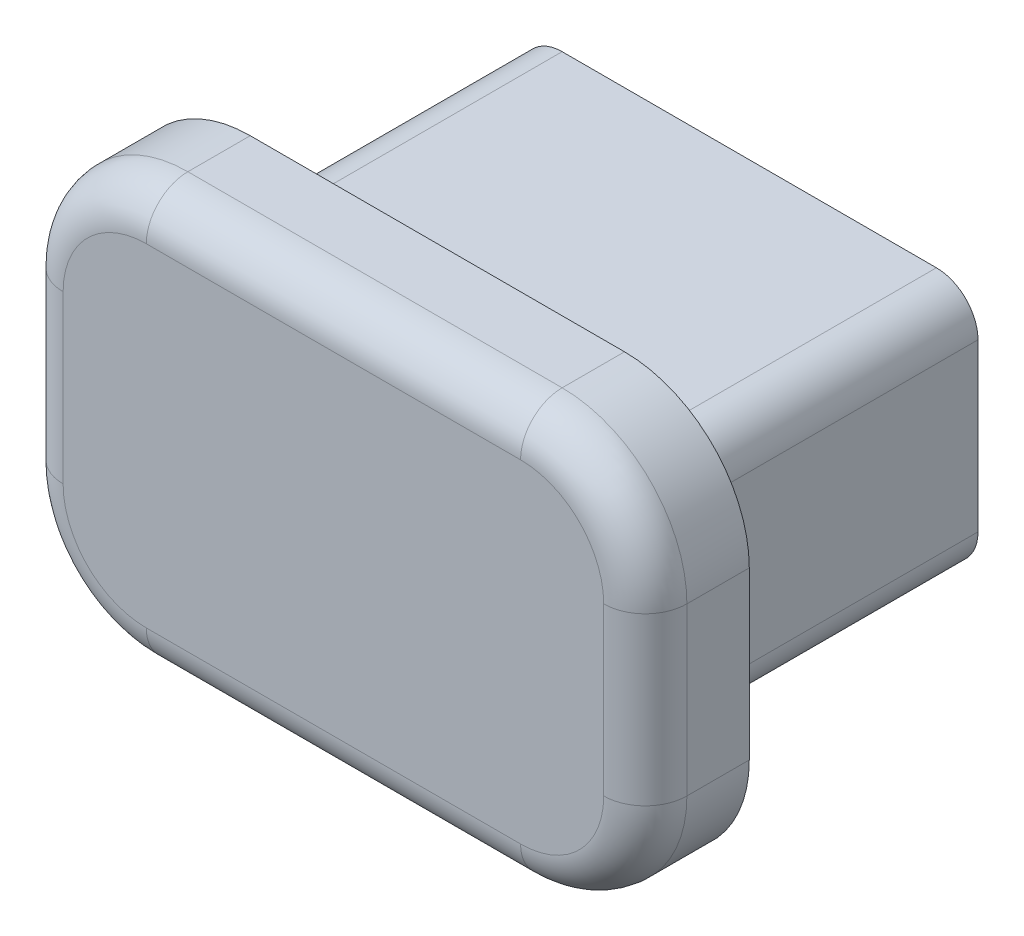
ISO-10303-21;
HEADER;
FILE_DESCRIPTION(('STEP AP214'),'2;1');
FILE_NAME('part.step','',(''),(''),'','','');
FILE_SCHEMA(('AUTOMOTIVE_DESIGN { 1 0 10303 214 1 1 1 1 }'));
ENDSEC;
DATA;
#1=APPLICATION_CONTEXT('core data for automotive mechanical design processes');
#2=APPLICATION_PROTOCOL_DEFINITION('international standard','automotive_design',2000,#1);
#3=PRODUCT_CONTEXT('',#1,'mechanical');
#4=PRODUCT('Part','Part','',(#3));
#5=PRODUCT_RELATED_PRODUCT_CATEGORY('part','',(#4));
#6=PRODUCT_DEFINITION_FORMATION('','',#4);
#7=PRODUCT_DEFINITION_CONTEXT('part definition',#1,'design');
#8=PRODUCT_DEFINITION('design','',#6,#7);
#9=PRODUCT_DEFINITION_SHAPE('','',#8);
#10=(LENGTH_UNIT() NAMED_UNIT(*) SI_UNIT(.MILLI.,.METRE.));
#11=(NAMED_UNIT(*) PLANE_ANGLE_UNIT() SI_UNIT($,.RADIAN.));
#12=(NAMED_UNIT(*) SI_UNIT($,.STERADIAN.) SOLID_ANGLE_UNIT());
#13=UNCERTAINTY_MEASURE_WITH_UNIT(LENGTH_MEASURE(1.E-05),#10,'distance_accuracy_value','');
#14=(GEOMETRIC_REPRESENTATION_CONTEXT(3) GLOBAL_UNCERTAINTY_ASSIGNED_CONTEXT((#13)) GLOBAL_UNIT_ASSIGNED_CONTEXT((#10,
#11,#12)) REPRESENTATION_CONTEXT('',''));
#15=CARTESIAN_POINT('',(0.,0.,0.));
#16=DIRECTION('',(0.,0.,1.));
#17=DIRECTION('',(1.,0.,0.));
#18=AXIS2_PLACEMENT_3D('',#15,#16,#17);
#19=CARTESIAN_POINT('',(-7.5,5.,10.));
#20=DIRECTION('',(1.,0.,0.));
#21=DIRECTION('',(0.,0.,-1.));
#22=AXIS2_PLACEMENT_3D('',#19,#20,#21);
#23=PLANE('',#22);
#24=DIRECTION('',(0.,0.,-1.));
#25=VECTOR('',#24,1.);
#26=CARTESIAN_POINT('',(-7.5,-2.,10.));
#27=LINE('',#26,#25);
#28=CARTESIAN_POINT('',(-7.5,-2.,7.5));
#29=VERTEX_POINT('',#28);
#30=CARTESIAN_POINT('',(-7.5,-2.,9.));
#31=VERTEX_POINT('',#30);
#32=EDGE_CURVE('E199',#29,#31,#27,.F.);
#33=ORIENTED_EDGE('',*,*,#32,.T.);
#34=DIRECTION('',(0.,-1.,0.));
#35=VECTOR('',#34,1.);
#36=CARTESIAN_POINT('',(-7.5,2.,9.));
#37=LINE('',#36,#35);
#38=CARTESIAN_POINT('',(-7.5,2.,9.));
#39=VERTEX_POINT('',#38);
#40=EDGE_CURVE('E237',#31,#39,#37,.F.);
#41=ORIENTED_EDGE('',*,*,#40,.T.);
#42=DIRECTION('',(0.,0.,-1.));
#43=VECTOR('',#42,1.);
#44=CARTESIAN_POINT('',(-7.5,2.,10.));
#45=LINE('',#44,#43);
#46=CARTESIAN_POINT('',(-7.5,2.,7.5));
#47=VERTEX_POINT('',#46);
#48=EDGE_CURVE('E192',#39,#47,#45,.T.);
#49=ORIENTED_EDGE('',*,*,#48,.T.);
#50=DIRECTION('',(0.,-1.,0.));
#51=VECTOR('',#50,1.);
#52=CARTESIAN_POINT('',(-7.5,5.,7.5));
#53=LINE('',#52,#51);
#54=EDGE_CURVE('E194',#47,#29,#53,.T.);
#55=ORIENTED_EDGE('',*,*,#54,.T.);
#56=EDGE_LOOP('',(#33,#41,#49,#55));
#57=FACE_BOUND('',#56,.T.);
#58=ADVANCED_FACE('F28',(#57),#23,.F.);
#59=CARTESIAN_POINT('',(-7.5,-5.,10.));
#60=DIRECTION('',(0.,1.,0.));
#61=DIRECTION('',(0.,0.,1.));
#62=AXIS2_PLACEMENT_3D('',#59,#60,#61);
#63=PLANE('',#62);
#64=DIRECTION('',(0.,0.,-1.));
#65=VECTOR('',#64,1.);
#66=CARTESIAN_POINT('',(4.5,-5.,10.));
#67=LINE('',#66,#65);
#68=CARTESIAN_POINT('',(4.5,-5.,7.5));
#69=VERTEX_POINT('',#68);
#70=CARTESIAN_POINT('',(4.5,-5.,9.));
#71=VERTEX_POINT('',#70);
#72=EDGE_CURVE('E181',#69,#71,#67,.F.);
#73=ORIENTED_EDGE('',*,*,#72,.T.);
#74=DIRECTION('',(1.,0.,0.));
#75=VECTOR('',#74,1.);
#76=CARTESIAN_POINT('',(-4.5,-5.,9.));
#77=LINE('',#76,#75);
#78=CARTESIAN_POINT('',(-4.5,-5.,9.));
#79=VERTEX_POINT('',#78);
#80=EDGE_CURVE('E233',#71,#79,#77,.F.);
#81=ORIENTED_EDGE('',*,*,#80,.T.);
#82=DIRECTION('',(0.,0.,-1.));
#83=VECTOR('',#82,1.);
#84=CARTESIAN_POINT('',(-4.5,-5.,10.));
#85=LINE('',#84,#83);
#86=CARTESIAN_POINT('',(-4.5,-5.,7.5));
#87=VERTEX_POINT('',#86);
#88=EDGE_CURVE('E184',#79,#87,#85,.T.);
#89=ORIENTED_EDGE('',*,*,#88,.T.);
#90=DIRECTION('',(1.,0.,0.));
#91=VECTOR('',#90,1.);
#92=CARTESIAN_POINT('',(-7.5,-5.,7.5));
#93=LINE('',#92,#91);
#94=EDGE_CURVE('E168',#87,#69,#93,.T.);
#95=ORIENTED_EDGE('',*,*,#94,.T.);
#96=EDGE_LOOP('',(#73,#81,#89,#95));
#97=FACE_BOUND('',#96,.T.);
#98=ADVANCED_FACE('F180',(#97),#63,.F.);
#99=CARTESIAN_POINT('',(7.5,5.,10.));
#100=DIRECTION('',(-1.,0.,0.));
#101=DIRECTION('',(0.,0.,1.));
#102=AXIS2_PLACEMENT_3D('',#99,#100,#101);
#103=PLANE('',#102);
#104=DIRECTION('',(0.,0.,-1.));
#105=VECTOR('',#104,1.);
#106=CARTESIAN_POINT('',(7.5,2.,10.));
#107=LINE('',#106,#105);
#108=CARTESIAN_POINT('',(7.5,2.,7.5));
#109=VERTEX_POINT('',#108);
#110=CARTESIAN_POINT('',(7.5,2.,9.));
#111=VERTEX_POINT('',#110);
#112=EDGE_CURVE('E176',#109,#111,#107,.F.);
#113=ORIENTED_EDGE('',*,*,#112,.T.);
#114=DIRECTION('',(0.,1.,0.));
#115=VECTOR('',#114,1.);
#116=CARTESIAN_POINT('',(7.5,-2.,9.));
#117=LINE('',#116,#115);
#118=CARTESIAN_POINT('',(7.5,-2.,9.));
#119=VERTEX_POINT('',#118);
#120=EDGE_CURVE('E230',#111,#119,#117,.F.);
#121=ORIENTED_EDGE('',*,*,#120,.T.);
#122=DIRECTION('',(0.,0.,-1.));
#123=VECTOR('',#122,1.);
#124=CARTESIAN_POINT('',(7.5,-2.,10.));
#125=LINE('',#124,#123);
#126=CARTESIAN_POINT('',(7.5,-2.,7.5));
#127=VERTEX_POINT('',#126);
#128=EDGE_CURVE('E207',#119,#127,#125,.T.);
#129=ORIENTED_EDGE('',*,*,#128,.T.);
#130=DIRECTION('',(0.,1.,0.));
#131=VECTOR('',#130,1.);
#132=CARTESIAN_POINT('',(7.5,5.,7.5));
#133=LINE('',#132,#131);
#134=EDGE_CURVE('E171',#127,#109,#133,.T.);
#135=ORIENTED_EDGE('',*,*,#134,.T.);
#136=EDGE_LOOP('',(#113,#121,#129,#135));
#137=FACE_BOUND('',#136,.T.);
#138=ADVANCED_FACE('F386',(#137),#103,.F.);
#139=CARTESIAN_POINT('',(-7.5,5.,10.));
#140=DIRECTION('',(0.,-1.,0.));
#141=DIRECTION('',(0.,0.,-1.));
#142=AXIS2_PLACEMENT_3D('',#139,#140,#141);
#143=PLANE('',#142);
#144=DIRECTION('',(0.,0.,-1.));
#145=VECTOR('',#144,1.);
#146=CARTESIAN_POINT('',(-4.5,5.,10.));
#147=LINE('',#146,#145);
#148=CARTESIAN_POINT('',(-4.5,5.,7.5));
#149=VERTEX_POINT('',#148);
#150=CARTESIAN_POINT('',(-4.5,5.,9.));
#151=VERTEX_POINT('',#150);
#152=EDGE_CURVE('E204',#149,#151,#147,.F.);
#153=ORIENTED_EDGE('',*,*,#152,.T.);
#154=DIRECTION('',(-1.,0.,0.));
#155=VECTOR('',#154,1.);
#156=CARTESIAN_POINT('',(4.5,5.,9.));
#157=LINE('',#156,#155);
#158=CARTESIAN_POINT('',(4.5,5.,9.));
#159=VERTEX_POINT('',#158);
#160=EDGE_CURVE('E241',#151,#159,#157,.F.);
#161=ORIENTED_EDGE('',*,*,#160,.T.);
#162=DIRECTION('',(0.,0.,-1.));
#163=VECTOR('',#162,1.);
#164=CARTESIAN_POINT('',(4.5,5.,10.));
#165=LINE('',#164,#163);
#166=CARTESIAN_POINT('',(4.5,5.,7.5));
#167=VERTEX_POINT('',#166);
#168=EDGE_CURVE('E202',#159,#167,#165,.T.);
#169=ORIENTED_EDGE('',*,*,#168,.T.);
#170=DIRECTION('',(-1.,0.,0.));
#171=VECTOR('',#170,1.);
#172=CARTESIAN_POINT('',(-7.5,5.,7.5));
#173=LINE('',#172,#171);
#174=EDGE_CURVE('E318',#167,#149,#173,.T.);
#175=ORIENTED_EDGE('',*,*,#174,.T.);
#176=EDGE_LOOP('',(#153,#161,#169,#175));
#177=FACE_BOUND('',#176,.T.);
#178=ADVANCED_FACE('F407',(#177),#143,.F.);
#179=CARTESIAN_POINT('',(-7.5,-5.,10.));
#180=DIRECTION('',(0.,0.,1.));
#181=DIRECTION('',(1.,0.,0.));
#182=AXIS2_PLACEMENT_3D('',#179,#180,#181);
#183=PLANE('',#182);
#184=DIRECTION('',(0.,1.,0.));
#185=VECTOR('',#184,1.);
#186=CARTESIAN_POINT('',(6.5,2.,10.));
#187=LINE('',#186,#185);
#188=CARTESIAN_POINT('',(6.5,-2.,10.));
#189=VERTEX_POINT('',#188);
#190=CARTESIAN_POINT('',(6.5,2.,10.));
#191=VERTEX_POINT('',#190);
#192=EDGE_CURVE('E222',#189,#191,#187,.T.);
#193=ORIENTED_EDGE('',*,*,#192,.T.);
#194=CARTESIAN_POINT('',(4.5,2.,10.));
#195=DIRECTION('',(0.,0.,1.));
#196=DIRECTION('',(1.,0.,0.));
#197=AXIS2_PLACEMENT_3D('',#194,#195,#196);
#198=CIRCLE('',#197,2.);
#199=CARTESIAN_POINT('',(4.5,4.,10.));
#200=VERTEX_POINT('',#199);
#201=EDGE_CURVE('E224',#191,#200,#198,.T.);
#202=ORIENTED_EDGE('',*,*,#201,.T.);
#203=DIRECTION('',(-1.,0.,0.));
#204=VECTOR('',#203,1.);
#205=CARTESIAN_POINT('',(-4.5,4.,10.));
#206=LINE('',#205,#204);
#207=CARTESIAN_POINT('',(-4.5,4.,10.));
#208=VERTEX_POINT('',#207);
#209=EDGE_CURVE('E175',#200,#208,#206,.T.);
#210=ORIENTED_EDGE('',*,*,#209,.T.);
#211=CARTESIAN_POINT('',(-4.5,2.,10.));
#212=DIRECTION('',(0.,0.,1.));
#213=DIRECTION('',(1.,0.,0.));
#214=AXIS2_PLACEMENT_3D('',#211,#212,#213);
#215=CIRCLE('',#214,2.);
#216=CARTESIAN_POINT('',(-6.5,2.,10.));
#217=VERTEX_POINT('',#216);
#218=EDGE_CURVE('E212',#208,#217,#215,.T.);
#219=ORIENTED_EDGE('',*,*,#218,.T.);
#220=DIRECTION('',(0.,-1.,0.));
#221=VECTOR('',#220,1.);
#222=CARTESIAN_POINT('',(-6.5,-2.,10.));
#223=LINE('',#222,#221);
#224=CARTESIAN_POINT('',(-6.5,-2.,10.));
#225=VERTEX_POINT('',#224);
#226=EDGE_CURVE('E214',#217,#225,#223,.T.);
#227=ORIENTED_EDGE('',*,*,#226,.T.);
#228=CARTESIAN_POINT('',(-4.5,-2.,10.));
#229=DIRECTION('',(0.,0.,1.));
#230=DIRECTION('',(1.,0.,0.));
#231=AXIS2_PLACEMENT_3D('',#228,#229,#230);
#232=CIRCLE('',#231,2.);
#233=CARTESIAN_POINT('',(-4.5,-4.,10.));
#234=VERTEX_POINT('',#233);
#235=EDGE_CURVE('E216',#225,#234,#232,.T.);
#236=ORIENTED_EDGE('',*,*,#235,.T.);
#237=DIRECTION('',(1.,0.,0.));
#238=VECTOR('',#237,1.);
#239=CARTESIAN_POINT('',(4.5,-4.,10.));
#240=LINE('',#239,#238);
#241=CARTESIAN_POINT('',(4.5,-4.,10.));
#242=VERTEX_POINT('',#241);
#243=EDGE_CURVE('E218',#234,#242,#240,.T.);
#244=ORIENTED_EDGE('',*,*,#243,.T.);
#245=CARTESIAN_POINT('',(4.5,-2.,10.));
#246=DIRECTION('',(0.,0.,1.));
#247=DIRECTION('',(1.,0.,0.));
#248=AXIS2_PLACEMENT_3D('',#245,#246,#247);
#249=CIRCLE('',#248,2.);
#250=EDGE_CURVE('E220',#242,#189,#249,.T.);
#251=ORIENTED_EDGE('',*,*,#250,.T.);
#252=EDGE_LOOP('',(#193,#202,#210,#219,#227,#236,#244,#251));
#253=FACE_BOUND('',#252,.T.);
#254=ADVANCED_FACE('F372',(#253),#183,.T.);
#255=CARTESIAN_POINT('',(-4.5,-2.,10.));
#256=DIRECTION('',(0.,0.,-1.));
#257=DIRECTION('',(-1.,0.,0.));
#258=AXIS2_PLACEMENT_3D('',#255,#256,#257);
#259=CYLINDRICAL_SURFACE('',#258,3.);
#260=ORIENTED_EDGE('',*,*,#88,.F.);
#261=CARTESIAN_POINT('',(-4.5,-2.,9.));
#262=DIRECTION('',(0.,0.,1.));
#263=DIRECTION('',(1.,0.,0.));
#264=AXIS2_PLACEMENT_3D('',#261,#262,#263);
#265=CIRCLE('',#264,3.);
#266=EDGE_CURVE('E235',#79,#31,#265,.F.);
#267=ORIENTED_EDGE('',*,*,#266,.T.);
#268=ORIENTED_EDGE('',*,*,#32,.F.);
#269=CARTESIAN_POINT('',(-4.5,-2.,7.5));
#270=DIRECTION('',(0.,0.,1.));
#271=DIRECTION('',(1.,0.,0.));
#272=AXIS2_PLACEMENT_3D('',#269,#270,#271);
#273=CIRCLE('',#272,3.);
#274=EDGE_CURVE('E316',#87,#29,#273,.F.);
#275=ORIENTED_EDGE('',*,*,#274,.F.);
#276=EDGE_LOOP('',(#260,#267,#268,#275));
#277=FACE_BOUND('',#276,.T.);
#278=ADVANCED_FACE('F328',(#277),#259,.T.);
#279=CARTESIAN_POINT('',(-4.5,2.,10.));
#280=DIRECTION('',(0.,0.,-1.));
#281=DIRECTION('',(-1.,0.,0.));
#282=AXIS2_PLACEMENT_3D('',#279,#280,#281);
#283=CYLINDRICAL_SURFACE('',#282,3.);
#284=ORIENTED_EDGE('',*,*,#48,.F.);
#285=CARTESIAN_POINT('',(-4.5,2.,9.));
#286=DIRECTION('',(0.,0.,1.));
#287=DIRECTION('',(1.,0.,0.));
#288=AXIS2_PLACEMENT_3D('',#285,#286,#287);
#289=CIRCLE('',#288,3.);
#290=EDGE_CURVE('E239',#39,#151,#289,.F.);
#291=ORIENTED_EDGE('',*,*,#290,.T.);
#292=ORIENTED_EDGE('',*,*,#152,.F.);
#293=CARTESIAN_POINT('',(-4.5,2.,7.5));
#294=DIRECTION('',(0.,0.,1.));
#295=DIRECTION('',(1.,0.,0.));
#296=AXIS2_PLACEMENT_3D('',#293,#294,#295);
#297=CIRCLE('',#296,3.);
#298=EDGE_CURVE('E190',#47,#149,#297,.F.);
#299=ORIENTED_EDGE('',*,*,#298,.F.);
#300=EDGE_LOOP('',(#284,#291,#292,#299));
#301=FACE_BOUND('',#300,.T.);
#302=ADVANCED_FACE('F419',(#301),#283,.T.);
#303=CARTESIAN_POINT('',(4.5,2.,10.));
#304=DIRECTION('',(0.,0.,-1.));
#305=DIRECTION('',(-1.,0.,0.));
#306=AXIS2_PLACEMENT_3D('',#303,#304,#305);
#307=CYLINDRICAL_SURFACE('',#306,3.);
#308=ORIENTED_EDGE('',*,*,#168,.F.);
#309=CARTESIAN_POINT('',(4.5,2.,9.));
#310=DIRECTION('',(0.,0.,1.));
#311=DIRECTION('',(1.,0.,0.));
#312=AXIS2_PLACEMENT_3D('',#309,#310,#311);
#313=CIRCLE('',#312,3.);
#314=EDGE_CURVE('E227',#159,#111,#313,.F.);
#315=ORIENTED_EDGE('',*,*,#314,.T.);
#316=ORIENTED_EDGE('',*,*,#112,.F.);
#317=CARTESIAN_POINT('',(4.5,2.,7.5));
#318=DIRECTION('',(0.,0.,1.));
#319=DIRECTION('',(1.,0.,0.));
#320=AXIS2_PLACEMENT_3D('',#317,#318,#319);
#321=CIRCLE('',#320,3.);
#322=EDGE_CURVE('E185',#167,#109,#321,.F.);
#323=ORIENTED_EDGE('',*,*,#322,.F.);
#324=EDGE_LOOP('',(#308,#315,#316,#323));
#325=FACE_BOUND('',#324,.T.);
#326=ADVANCED_FACE('F384',(#325),#307,.T.);
#327=CARTESIAN_POINT('',(4.5,-2.,10.));
#328=DIRECTION('',(0.,0.,-1.));
#329=DIRECTION('',(-1.,0.,0.));
#330=AXIS2_PLACEMENT_3D('',#327,#328,#329);
#331=CYLINDRICAL_SURFACE('',#330,3.);
#332=ORIENTED_EDGE('',*,*,#128,.F.);
#333=CARTESIAN_POINT('',(4.5,-2.,9.));
#334=DIRECTION('',(0.,0.,1.));
#335=DIRECTION('',(1.,0.,0.));
#336=AXIS2_PLACEMENT_3D('',#333,#334,#335);
#337=CIRCLE('',#336,3.);
#338=EDGE_CURVE('E189',#119,#71,#337,.F.);
#339=ORIENTED_EDGE('',*,*,#338,.T.);
#340=ORIENTED_EDGE('',*,*,#72,.F.);
#341=CARTESIAN_POINT('',(4.5,-2.,7.5));
#342=DIRECTION('',(0.,0.,1.));
#343=DIRECTION('',(1.,0.,0.));
#344=AXIS2_PLACEMENT_3D('',#341,#342,#343);
#345=CIRCLE('',#344,3.);
#346=EDGE_CURVE('E165',#127,#69,#345,.F.);
#347=ORIENTED_EDGE('',*,*,#346,.F.);
#348=EDGE_LOOP('',(#332,#339,#340,#347));
#349=FACE_BOUND('',#348,.T.);
#350=ADVANCED_FACE('F187',(#349),#331,.T.);
#351=CARTESIAN_POINT('',(5.5,3.,28.8667837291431));
#352=DIRECTION('',(1.,0.,0.));
#353=DIRECTION('',(0.,1.,0.));
#354=AXIS2_PLACEMENT_3D('',#351,#352,#353);
#355=PLANE('',#354);
#356=DIRECTION('',(0.,-1.,0.));
#357=VECTOR('',#356,1.);
#358=CARTESIAN_POINT('',(5.5,3.,7.5));
#359=LINE('',#358,#357);
#360=CARTESIAN_POINT('',(5.5,2.,7.5));
#361=VERTEX_POINT('',#360);
#362=CARTESIAN_POINT('',(5.5,-2.,7.5));
#363=VERTEX_POINT('',#362);
#364=EDGE_CURVE('E308',#361,#363,#359,.T.);
#365=ORIENTED_EDGE('',*,*,#364,.T.);
#366=DIRECTION('',(0.,0.,-1.));
#367=VECTOR('',#366,1.);
#368=CARTESIAN_POINT('',(5.5,-2.,28.8667837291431));
#369=LINE('',#368,#367);
#370=CARTESIAN_POINT('',(5.5,-2.,0.));
#371=VERTEX_POINT('',#370);
#372=EDGE_CURVE('E245',#363,#371,#369,.T.);
#373=ORIENTED_EDGE('',*,*,#372,.T.);
#374=DIRECTION('',(0.,-1.,0.));
#375=VECTOR('',#374,1.);
#376=CARTESIAN_POINT('',(5.5,3.,0.));
#377=LINE('',#376,#375);
#378=CARTESIAN_POINT('',(5.5,2.,0.));
#379=VERTEX_POINT('',#378);
#380=EDGE_CURVE('E297',#379,#371,#377,.T.);
#381=ORIENTED_EDGE('',*,*,#380,.F.);
#382=DIRECTION('',(0.,0.,-1.));
#383=VECTOR('',#382,1.);
#384=CARTESIAN_POINT('',(5.5,2.,28.8667837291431));
#385=LINE('',#384,#383);
#386=EDGE_CURVE('E243',#379,#361,#385,.F.);
#387=ORIENTED_EDGE('',*,*,#386,.T.);
#388=EDGE_LOOP('',(#365,#373,#381,#387));
#389=FACE_BOUND('',#388,.T.);
#390=ADVANCED_FACE('F427',(#389),#355,.T.);
#391=CARTESIAN_POINT('',(5.5,3.,28.8667837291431));
#392=DIRECTION('',(0.,1.,0.));
#393=DIRECTION('',(0.,0.,1.));
#394=AXIS2_PLACEMENT_3D('',#391,#392,#393);
#395=PLANE('',#394);
#396=DIRECTION('',(1.,0.,0.));
#397=VECTOR('',#396,1.);
#398=CARTESIAN_POINT('',(5.5,3.,0.));
#399=LINE('',#398,#397);
#400=CARTESIAN_POINT('',(-4.5,3.,0.));
#401=VERTEX_POINT('',#400);
#402=CARTESIAN_POINT('',(4.5,3.,0.));
#403=VERTEX_POINT('',#402);
#404=EDGE_CURVE('E293',#401,#403,#399,.T.);
#405=ORIENTED_EDGE('',*,*,#404,.F.);
#406=DIRECTION('',(0.,0.,-1.));
#407=VECTOR('',#406,1.);
#408=CARTESIAN_POINT('',(-4.5,3.,28.8667837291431));
#409=LINE('',#408,#407);
#410=CARTESIAN_POINT('',(-4.5,3.,7.5));
#411=VERTEX_POINT('',#410);
#412=EDGE_CURVE('E47',#401,#411,#409,.F.);
#413=ORIENTED_EDGE('',*,*,#412,.T.);
#414=DIRECTION('',(1.,0.,0.));
#415=VECTOR('',#414,1.);
#416=CARTESIAN_POINT('',(5.5,3.,7.5));
#417=LINE('',#416,#415);
#418=CARTESIAN_POINT('',(4.5,3.,7.5));
#419=VERTEX_POINT('',#418);
#420=EDGE_CURVE('E278',#411,#419,#417,.T.);
#421=ORIENTED_EDGE('',*,*,#420,.T.);
#422=DIRECTION('',(0.,0.,-1.));
#423=VECTOR('',#422,1.);
#424=CARTESIAN_POINT('',(4.5,3.,28.8667837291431));
#425=LINE('',#424,#423);
#426=EDGE_CURVE('E266',#419,#403,#425,.T.);
#427=ORIENTED_EDGE('',*,*,#426,.T.);
#428=EDGE_LOOP('',(#405,#413,#421,#427));
#429=FACE_BOUND('',#428,.T.);
#430=ADVANCED_FACE('F295',(#429),#395,.T.);
#431=CARTESIAN_POINT('',(-5.5,3.,28.8667837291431));
#432=DIRECTION('',(-1.,0.,0.));
#433=DIRECTION('',(0.,-1.,0.));
#434=AXIS2_PLACEMENT_3D('',#431,#432,#433);
#435=PLANE('',#434);
#436=DIRECTION('',(0.,1.,0.));
#437=VECTOR('',#436,1.);
#438=CARTESIAN_POINT('',(-5.5,3.,0.));
#439=LINE('',#438,#437);
#440=CARTESIAN_POINT('',(-5.5,-2.,0.));
#441=VERTEX_POINT('',#440);
#442=CARTESIAN_POINT('',(-5.5,2.,0.));
#443=VERTEX_POINT('',#442);
#444=EDGE_CURVE('E294',#441,#443,#439,.T.);
#445=ORIENTED_EDGE('',*,*,#444,.F.);
#446=DIRECTION('',(0.,0.,-1.));
#447=VECTOR('',#446,1.);
#448=CARTESIAN_POINT('',(-5.5,-2.,28.8667837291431));
#449=LINE('',#448,#447);
#450=CARTESIAN_POINT('',(-5.5,-2.,7.5));
#451=VERTEX_POINT('',#450);
#452=EDGE_CURVE('E264',#441,#451,#449,.F.);
#453=ORIENTED_EDGE('',*,*,#452,.T.);
#454=DIRECTION('',(0.,1.,0.));
#455=VECTOR('',#454,1.);
#456=CARTESIAN_POINT('',(-5.5,3.,7.5));
#457=LINE('',#456,#455);
#458=CARTESIAN_POINT('',(-5.5,2.,7.5));
#459=VERTEX_POINT('',#458);
#460=EDGE_CURVE('E276',#451,#459,#457,.T.);
#461=ORIENTED_EDGE('',*,*,#460,.T.);
#462=DIRECTION('',(0.,0.,-1.));
#463=VECTOR('',#462,1.);
#464=CARTESIAN_POINT('',(-5.5,2.,28.8667837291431));
#465=LINE('',#464,#463);
#466=EDGE_CURVE('E261',#459,#443,#465,.T.);
#467=ORIENTED_EDGE('',*,*,#466,.T.);
#468=EDGE_LOOP('',(#445,#453,#461,#467));
#469=FACE_BOUND('',#468,.T.);
#470=ADVANCED_FACE('F283',(#469),#435,.T.);
#471=CARTESIAN_POINT('',(5.5,-3.,28.8667837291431));
#472=DIRECTION('',(0.,-1.,0.));
#473=DIRECTION('',(0.,0.,-1.));
#474=AXIS2_PLACEMENT_3D('',#471,#472,#473);
#475=PLANE('',#474);
#476=DIRECTION('',(-1.,0.,0.));
#477=VECTOR('',#476,1.);
#478=CARTESIAN_POINT('',(5.5,-3.,0.));
#479=LINE('',#478,#477);
#480=CARTESIAN_POINT('',(4.5,-3.,0.));
#481=VERTEX_POINT('',#480);
#482=CARTESIAN_POINT('',(-4.5,-3.,0.));
#483=VERTEX_POINT('',#482);
#484=EDGE_CURVE('E299',#481,#483,#479,.T.);
#485=ORIENTED_EDGE('',*,*,#484,.F.);
#486=DIRECTION('',(0.,0.,-1.));
#487=VECTOR('',#486,1.);
#488=CARTESIAN_POINT('',(4.5,-3.,28.8667837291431));
#489=LINE('',#488,#487);
#490=CARTESIAN_POINT('',(4.5,-3.,7.5));
#491=VERTEX_POINT('',#490);
#492=EDGE_CURVE('E259',#481,#491,#489,.F.);
#493=ORIENTED_EDGE('',*,*,#492,.T.);
#494=DIRECTION('',(-1.,0.,0.));
#495=VECTOR('',#494,1.);
#496=CARTESIAN_POINT('',(5.5,-3.,7.5));
#497=LINE('',#496,#495);
#498=CARTESIAN_POINT('',(-4.5,-3.,7.5));
#499=VERTEX_POINT('',#498);
#500=EDGE_CURVE('E286',#491,#499,#497,.T.);
#501=ORIENTED_EDGE('',*,*,#500,.T.);
#502=DIRECTION('',(0.,0.,-1.));
#503=VECTOR('',#502,1.);
#504=CARTESIAN_POINT('',(-4.5,-3.,28.8667837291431));
#505=LINE('',#504,#503);
#506=EDGE_CURVE('E256',#499,#483,#505,.T.);
#507=ORIENTED_EDGE('',*,*,#506,.T.);
#508=EDGE_LOOP('',(#485,#493,#501,#507));
#509=FACE_BOUND('',#508,.T.);
#510=ADVANCED_FACE('F430',(#509),#475,.T.);
#511=CARTESIAN_POINT('',(-7.5,-5.,7.5));
#512=DIRECTION('',(0.,0.,1.));
#513=DIRECTION('',(1.,0.,0.));
#514=AXIS2_PLACEMENT_3D('',#511,#512,#513);
#515=PLANE('',#514);
#516=ORIENTED_EDGE('',*,*,#298,.T.);
#517=ORIENTED_EDGE('',*,*,#174,.F.);
#518=ORIENTED_EDGE('',*,*,#322,.T.);
#519=ORIENTED_EDGE('',*,*,#134,.F.);
#520=ORIENTED_EDGE('',*,*,#346,.T.);
#521=ORIENTED_EDGE('',*,*,#94,.F.);
#522=ORIENTED_EDGE('',*,*,#274,.T.);
#523=ORIENTED_EDGE('',*,*,#54,.F.);
#524=EDGE_LOOP('',(#516,#517,#518,#519,#520,#521,#522,#523));
#525=FACE_BOUND('',#524,.T.);
#526=ORIENTED_EDGE('',*,*,#420,.F.);
#527=CARTESIAN_POINT('',(-4.5,2.,7.5));
#528=DIRECTION('',(0.,0.,1.));
#529=DIRECTION('',(1.,0.,0.));
#530=AXIS2_PLACEMENT_3D('',#527,#528,#529);
#531=CIRCLE('',#530,1.);
#532=EDGE_CURVE('E35',#411,#459,#531,.T.);
#533=ORIENTED_EDGE('',*,*,#532,.T.);
#534=ORIENTED_EDGE('',*,*,#460,.F.);
#535=CARTESIAN_POINT('',(-4.5,-2.,7.5));
#536=DIRECTION('',(0.,0.,1.));
#537=DIRECTION('',(1.,0.,0.));
#538=AXIS2_PLACEMENT_3D('',#535,#536,#537);
#539=CIRCLE('',#538,1.);
#540=EDGE_CURVE('E272',#451,#499,#539,.T.);
#541=ORIENTED_EDGE('',*,*,#540,.T.);
#542=ORIENTED_EDGE('',*,*,#500,.F.);
#543=CARTESIAN_POINT('',(4.5,-2.,7.5));
#544=DIRECTION('',(0.,0.,1.));
#545=DIRECTION('',(1.,0.,0.));
#546=AXIS2_PLACEMENT_3D('',#543,#544,#545);
#547=CIRCLE('',#546,1.);
#548=EDGE_CURVE('E270',#491,#363,#547,.T.);
#549=ORIENTED_EDGE('',*,*,#548,.T.);
#550=ORIENTED_EDGE('',*,*,#364,.F.);
#551=CARTESIAN_POINT('',(4.5,2.,7.5));
#552=DIRECTION('',(0.,0.,1.));
#553=DIRECTION('',(1.,0.,0.));
#554=AXIS2_PLACEMENT_3D('',#551,#552,#553);
#555=CIRCLE('',#554,1.);
#556=EDGE_CURVE('E12',#361,#419,#555,.T.);
#557=ORIENTED_EDGE('',*,*,#556,.T.);
#558=EDGE_LOOP('',(#526,#533,#534,#541,#542,#549,#550,#557));
#559=FACE_BOUND('',#558,.T.);
#560=ADVANCED_FACE('F167',(#525,#559),#515,.F.);
#561=CARTESIAN_POINT('',(-7.5,-5.,0.));
#562=DIRECTION('',(0.,0.,1.));
#563=DIRECTION('',(1.,0.,0.));
#564=AXIS2_PLACEMENT_3D('',#561,#562,#563);
#565=PLANE('',#564);
#566=ORIENTED_EDGE('',*,*,#380,.T.);
#567=CARTESIAN_POINT('',(4.5,-2.,0.));
#568=DIRECTION('',(0.,0.,1.));
#569=DIRECTION('',(1.,0.,0.));
#570=AXIS2_PLACEMENT_3D('',#567,#568,#569);
#571=CIRCLE('',#570,1.);
#572=EDGE_CURVE('E254',#371,#481,#571,.F.);
#573=ORIENTED_EDGE('',*,*,#572,.T.);
#574=ORIENTED_EDGE('',*,*,#484,.T.);
#575=CARTESIAN_POINT('',(-4.5,-2.,0.));
#576=DIRECTION('',(0.,0.,1.));
#577=DIRECTION('',(1.,0.,0.));
#578=AXIS2_PLACEMENT_3D('',#575,#576,#577);
#579=CIRCLE('',#578,1.);
#580=EDGE_CURVE('E252',#483,#441,#579,.F.);
#581=ORIENTED_EDGE('',*,*,#580,.T.);
#582=ORIENTED_EDGE('',*,*,#444,.T.);
#583=CARTESIAN_POINT('',(-4.5,2.,0.));
#584=DIRECTION('',(0.,0.,1.));
#585=DIRECTION('',(1.,0.,0.));
#586=AXIS2_PLACEMENT_3D('',#583,#584,#585);
#587=CIRCLE('',#586,1.);
#588=EDGE_CURVE('E250',#443,#401,#587,.F.);
#589=ORIENTED_EDGE('',*,*,#588,.T.);
#590=ORIENTED_EDGE('',*,*,#404,.T.);
#591=CARTESIAN_POINT('',(4.5,2.,0.));
#592=DIRECTION('',(0.,0.,1.));
#593=DIRECTION('',(1.,0.,0.));
#594=AXIS2_PLACEMENT_3D('',#591,#592,#593);
#595=CIRCLE('',#594,1.);
#596=EDGE_CURVE('E248',#403,#379,#595,.F.);
#597=ORIENTED_EDGE('',*,*,#596,.T.);
#598=EDGE_LOOP('',(#566,#573,#574,#581,#582,#589,#590,#597));
#599=FACE_BOUND('',#598,.T.);
#600=ADVANCED_FACE('F292',(#599),#565,.F.);
#601=CARTESIAN_POINT('',(-4.5,-2.,9.));
#602=DIRECTION('',(0.,0.,1.));
#603=DIRECTION('',(1.,0.,0.));
#604=AXIS2_PLACEMENT_3D('',#601,#602,#603);
#605=TOROIDAL_SURFACE('',#604,2.,1.);
#606=CARTESIAN_POINT('',(-6.5,-2.,9.));
#607=DIRECTION('',(0.,1.,0.));
#608=DIRECTION('',(0.,0.,1.));
#609=AXIS2_PLACEMENT_3D('',#606,#607,#608);
#610=CIRCLE('',#609,1.);
#611=EDGE_CURVE('E337',#31,#225,#610,.T.);
#612=ORIENTED_EDGE('',*,*,#611,.F.);
#613=ORIENTED_EDGE('',*,*,#266,.F.);
#614=CARTESIAN_POINT('',(-4.5,-4.,9.));
#615=DIRECTION('',(1.,0.,0.));
#616=DIRECTION('',(0.,0.,-1.));
#617=AXIS2_PLACEMENT_3D('',#614,#615,#616);
#618=CIRCLE('',#617,1.);
#619=EDGE_CURVE('E301',#234,#79,#618,.T.);
#620=ORIENTED_EDGE('',*,*,#619,.F.);
#621=ORIENTED_EDGE('',*,*,#235,.F.);
#622=EDGE_LOOP('',(#612,#613,#620,#621));
#623=FACE_BOUND('',#622,.T.);
#624=ADVANCED_FACE('F333',(#623),#605,.T.);
#625=CARTESIAN_POINT('',(-7.5,-4.,9.));
#626=DIRECTION('',(-1.,0.,0.));
#627=DIRECTION('',(0.,0.,1.));
#628=AXIS2_PLACEMENT_3D('',#625,#626,#627);
#629=CYLINDRICAL_SURFACE('',#628,1.);
#630=ORIENTED_EDGE('',*,*,#619,.T.);
#631=ORIENTED_EDGE('',*,*,#80,.F.);
#632=CARTESIAN_POINT('',(4.5,-4.,9.));
#633=DIRECTION('',(1.,0.,0.));
#634=DIRECTION('',(0.,0.,-1.));
#635=AXIS2_PLACEMENT_3D('',#632,#633,#634);
#636=CIRCLE('',#635,1.);
#637=EDGE_CURVE('E343',#242,#71,#636,.T.);
#638=ORIENTED_EDGE('',*,*,#637,.F.);
#639=ORIENTED_EDGE('',*,*,#243,.F.);
#640=EDGE_LOOP('',(#630,#631,#638,#639));
#641=FACE_BOUND('',#640,.T.);
#642=ADVANCED_FACE('F340',(#641),#629,.T.);
#643=CARTESIAN_POINT('',(-6.5,-5.,9.));
#644=DIRECTION('',(0.,1.,0.));
#645=DIRECTION('',(0.,0.,1.));
#646=AXIS2_PLACEMENT_3D('',#643,#644,#645);
#647=CYLINDRICAL_SURFACE('',#646,1.);
#648=ORIENTED_EDGE('',*,*,#611,.T.);
#649=ORIENTED_EDGE('',*,*,#226,.F.);
#650=CARTESIAN_POINT('',(-6.5,2.,9.));
#651=DIRECTION('',(0.,1.,0.));
#652=DIRECTION('',(0.,0.,1.));
#653=AXIS2_PLACEMENT_3D('',#650,#651,#652);
#654=CIRCLE('',#653,1.);
#655=EDGE_CURVE('E346',#39,#217,#654,.T.);
#656=ORIENTED_EDGE('',*,*,#655,.F.);
#657=ORIENTED_EDGE('',*,*,#40,.F.);
#658=EDGE_LOOP('',(#648,#649,#656,#657));
#659=FACE_BOUND('',#658,.T.);
#660=ADVANCED_FACE('F391',(#659),#647,.T.);
#661=CARTESIAN_POINT('',(4.5,-2.,9.));
#662=DIRECTION('',(0.,0.,1.));
#663=DIRECTION('',(1.,0.,0.));
#664=AXIS2_PLACEMENT_3D('',#661,#662,#663);
#665=TOROIDAL_SURFACE('',#664,2.,1.);
#666=ORIENTED_EDGE('',*,*,#637,.T.);
#667=ORIENTED_EDGE('',*,*,#338,.F.);
#668=CARTESIAN_POINT('',(6.5,-2.,9.));
#669=DIRECTION('',(0.,1.,0.));
#670=DIRECTION('',(0.,0.,1.));
#671=AXIS2_PLACEMENT_3D('',#668,#669,#670);
#672=CIRCLE('',#671,1.);
#673=EDGE_CURVE('E351',#189,#119,#672,.T.);
#674=ORIENTED_EDGE('',*,*,#673,.F.);
#675=ORIENTED_EDGE('',*,*,#250,.F.);
#676=EDGE_LOOP('',(#666,#667,#674,#675));
#677=FACE_BOUND('',#676,.T.);
#678=ADVANCED_FACE('F388',(#677),#665,.T.);
#679=CARTESIAN_POINT('',(-4.5,2.,9.));
#680=DIRECTION('',(0.,0.,1.));
#681=DIRECTION('',(1.,0.,0.));
#682=AXIS2_PLACEMENT_3D('',#679,#680,#681);
#683=TOROIDAL_SURFACE('',#682,2.,1.);
#684=ORIENTED_EDGE('',*,*,#655,.T.);
#685=ORIENTED_EDGE('',*,*,#218,.F.);
#686=CARTESIAN_POINT('',(-4.5,4.,9.));
#687=DIRECTION('',(1.,0.,0.));
#688=DIRECTION('',(0.,0.,-1.));
#689=AXIS2_PLACEMENT_3D('',#686,#687,#688);
#690=CIRCLE('',#689,1.);
#691=EDGE_CURVE('E354',#151,#208,#690,.T.);
#692=ORIENTED_EDGE('',*,*,#691,.F.);
#693=ORIENTED_EDGE('',*,*,#290,.F.);
#694=EDGE_LOOP('',(#684,#685,#692,#693));
#695=FACE_BOUND('',#694,.T.);
#696=ADVANCED_FACE('F390',(#695),#683,.T.);
#697=CARTESIAN_POINT('',(6.5,-5.,9.));
#698=DIRECTION('',(0.,-1.,0.));
#699=DIRECTION('',(0.,0.,-1.));
#700=AXIS2_PLACEMENT_3D('',#697,#698,#699);
#701=CYLINDRICAL_SURFACE('',#700,1.);
#702=ORIENTED_EDGE('',*,*,#673,.T.);
#703=ORIENTED_EDGE('',*,*,#120,.F.);
#704=CARTESIAN_POINT('',(6.5,2.,9.));
#705=DIRECTION('',(0.,1.,0.));
#706=DIRECTION('',(0.,0.,1.));
#707=AXIS2_PLACEMENT_3D('',#704,#705,#706);
#708=CIRCLE('',#707,1.);
#709=EDGE_CURVE('E357',#191,#111,#708,.T.);
#710=ORIENTED_EDGE('',*,*,#709,.F.);
#711=ORIENTED_EDGE('',*,*,#192,.F.);
#712=EDGE_LOOP('',(#702,#703,#710,#711));
#713=FACE_BOUND('',#712,.T.);
#714=ADVANCED_FACE('F379',(#713),#701,.T.);
#715=CARTESIAN_POINT('',(-7.5,4.,9.));
#716=DIRECTION('',(1.,0.,0.));
#717=DIRECTION('',(0.,0.,-1.));
#718=AXIS2_PLACEMENT_3D('',#715,#716,#717);
#719=CYLINDRICAL_SURFACE('',#718,1.);
#720=ORIENTED_EDGE('',*,*,#691,.T.);
#721=ORIENTED_EDGE('',*,*,#209,.F.);
#722=CARTESIAN_POINT('',(4.5,4.,9.));
#723=DIRECTION('',(1.,0.,0.));
#724=DIRECTION('',(0.,0.,-1.));
#725=AXIS2_PLACEMENT_3D('',#722,#723,#724);
#726=CIRCLE('',#725,1.);
#727=EDGE_CURVE('E359',#159,#200,#726,.T.);
#728=ORIENTED_EDGE('',*,*,#727,.F.);
#729=ORIENTED_EDGE('',*,*,#160,.F.);
#730=EDGE_LOOP('',(#720,#721,#728,#729));
#731=FACE_BOUND('',#730,.T.);
#732=ADVANCED_FACE('F368',(#731),#719,.T.);
#733=CARTESIAN_POINT('',(4.5,2.,9.));
#734=DIRECTION('',(0.,0.,1.));
#735=DIRECTION('',(1.,0.,0.));
#736=AXIS2_PLACEMENT_3D('',#733,#734,#735);
#737=TOROIDAL_SURFACE('',#736,2.,1.);
#738=ORIENTED_EDGE('',*,*,#709,.T.);
#739=ORIENTED_EDGE('',*,*,#314,.F.);
#740=ORIENTED_EDGE('',*,*,#727,.T.);
#741=ORIENTED_EDGE('',*,*,#201,.F.);
#742=EDGE_LOOP('',(#738,#739,#740,#741));
#743=FACE_BOUND('',#742,.T.);
#744=ADVANCED_FACE('F365',(#743),#737,.T.);
#745=CARTESIAN_POINT('',(4.5,-2.,28.8667837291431));
#746=DIRECTION('',(0.,0.,-1.));
#747=DIRECTION('',(-1.,0.,0.));
#748=AXIS2_PLACEMENT_3D('',#745,#746,#747);
#749=CYLINDRICAL_SURFACE('',#748,1.);
#750=ORIENTED_EDGE('',*,*,#548,.F.);
#751=ORIENTED_EDGE('',*,*,#492,.F.);
#752=ORIENTED_EDGE('',*,*,#572,.F.);
#753=ORIENTED_EDGE('',*,*,#372,.F.);
#754=EDGE_LOOP('',(#750,#751,#752,#753));
#755=FACE_BOUND('',#754,.T.);
#756=ADVANCED_FACE('F477',(#755),#749,.T.);
#757=CARTESIAN_POINT('',(-4.5,-2.,28.8667837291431));
#758=DIRECTION('',(0.,0.,-1.));
#759=DIRECTION('',(-1.,0.,0.));
#760=AXIS2_PLACEMENT_3D('',#757,#758,#759);
#761=CYLINDRICAL_SURFACE('',#760,1.);
#762=ORIENTED_EDGE('',*,*,#540,.F.);
#763=ORIENTED_EDGE('',*,*,#452,.F.);
#764=ORIENTED_EDGE('',*,*,#580,.F.);
#765=ORIENTED_EDGE('',*,*,#506,.F.);
#766=EDGE_LOOP('',(#762,#763,#764,#765));
#767=FACE_BOUND('',#766,.T.);
#768=ADVANCED_FACE('F484',(#767),#761,.T.);
#769=CARTESIAN_POINT('',(-4.5,2.,28.8667837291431));
#770=DIRECTION('',(0.,0.,-1.));
#771=DIRECTION('',(-1.,0.,0.));
#772=AXIS2_PLACEMENT_3D('',#769,#770,#771);
#773=CYLINDRICAL_SURFACE('',#772,1.);
#774=ORIENTED_EDGE('',*,*,#532,.F.);
#775=ORIENTED_EDGE('',*,*,#412,.F.);
#776=ORIENTED_EDGE('',*,*,#588,.F.);
#777=ORIENTED_EDGE('',*,*,#466,.F.);
#778=EDGE_LOOP('',(#774,#775,#776,#777));
#779=FACE_BOUND('',#778,.T.);
#780=ADVANCED_FACE('F288',(#779),#773,.T.);
#781=CARTESIAN_POINT('',(4.5,2.,28.8667837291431));
#782=DIRECTION('',(0.,0.,-1.));
#783=DIRECTION('',(-1.,0.,0.));
#784=AXIS2_PLACEMENT_3D('',#781,#782,#783);
#785=CYLINDRICAL_SURFACE('',#784,1.);
#786=ORIENTED_EDGE('',*,*,#556,.F.);
#787=ORIENTED_EDGE('',*,*,#386,.F.);
#788=ORIENTED_EDGE('',*,*,#596,.F.);
#789=ORIENTED_EDGE('',*,*,#426,.F.);
#790=EDGE_LOOP('',(#786,#787,#788,#789));
#791=FACE_BOUND('',#790,.T.);
#792=ADVANCED_FACE('F499',(#791),#785,.T.);
#793=CLOSED_SHELL('',(#58,#98,#138,#178,#254,#278,#302,#326,#350,#390,#430,#470,#510,#560,#600,
#624,#642,#660,#678,#696,#714,#732,#744,#756,#768,#780,#792));
#794=MANIFOLD_SOLID_BREP('B2',#793);
#795=ADVANCED_BREP_SHAPE_REPRESENTATION('',(#18,#794),#14);
#796=SHAPE_DEFINITION_REPRESENTATION(#9,#795);
ENDSEC;
END-ISO-10303-21;
